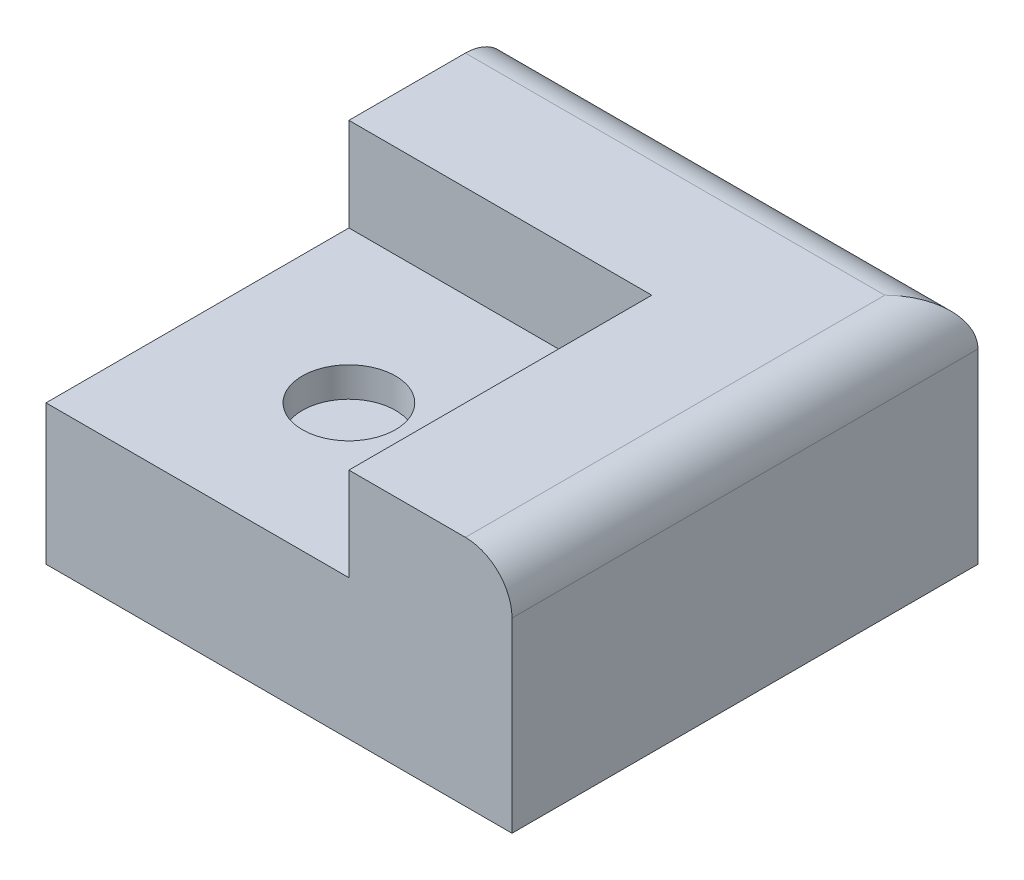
from build123d import *

# Parameters (mm, degrees)
SKETCH1_W       = 127
SKETCH1_H       = 127
EXTRUDE1_DEPTH  = 63.5
SKETCH3_W       = 82.55
SKETCH3_H       = 82.55
INSET_CUT_DEPTH = 25.4
FILLET1_R       = 12.7
SKETCH4_R       = 12.7
HOLE_DEPTH      = 8.128


with BuildPart() as part:
    # Sketch1 → Extrude1 (new body)
    with BuildSketch(Plane(origin=(0, 0, 0), x_dir=(1, 0, 0), z_dir=(0, 1, 0))):
        Rectangle(SKETCH1_W, SKETCH1_H)
    extrude(amount=EXTRUDE1_DEPTH)

    # Sketch3 → Inset Cut (cut)
    with BuildSketch(Plane(origin=(0, 63.5, 0), x_dir=(-1, 0, 0), z_dir=(0, 1, 0))):
        with Locations((22.225, 22.225)):
            Rectangle(SKETCH3_W, SKETCH3_H)
    extrude(amount=-INSET_CUT_DEPTH, mode=Mode.SUBTRACT)

    # Fillet1
    fillet1_edges = [part.edges().sort_by_distance(p)[0] for p in [
        (63.5, 63.5, 0),
        (0, 63.5, -63.5),
    ]]
    fillet(fillet1_edges, radius=FILLET1_R)

    # Sketch4 → Hole (cut)
    with BuildSketch(Plane(origin=(0, 38.1, 0), x_dir=(-1, 0, 0), z_dir=(0, 1, 0))):
        with Locations(Location((22.225, 22.225, 0), (0, 0, 90))):
            Circle(SKETCH4_R)
    extrude(amount=-HOLE_DEPTH, mode=Mode.SUBTRACT)


solid = part.part
